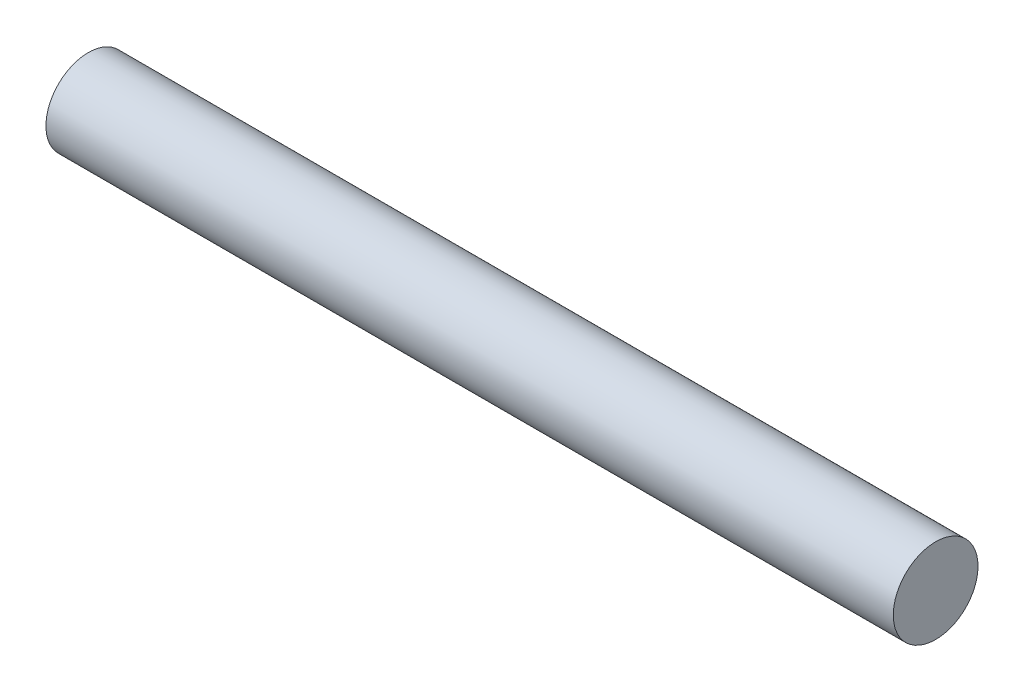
from build123d import *

# Parameters (mm, degrees)
SZKIC1_R                    = 5
DODANIE_WYCI_GNI_CIE1_DEPTH = 100


with BuildPart() as part:
    # Szkic1 → Dodanie-wyci_gni_cie1 (new body)
    with BuildSketch(Plane(origin=(0, 0, 0), x_dir=(0, 0, -1), z_dir=(1, 0, 0))):
        Circle(SZKIC1_R)
    extrude(amount=DODANIE_WYCI_GNI_CIE1_DEPTH)


solid = part.part
